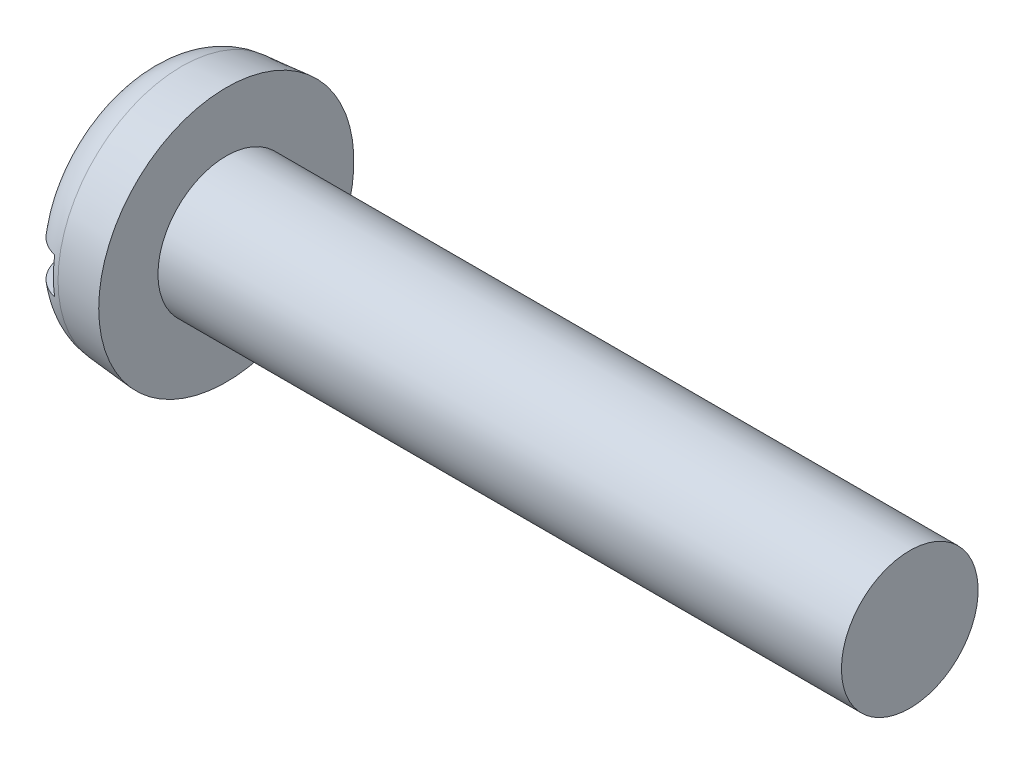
ISO-10303-21;
HEADER;
FILE_DESCRIPTION(('STEP AP214'),'2;1');
FILE_NAME('part.step','',(''),(''),'','','');
FILE_SCHEMA(('AUTOMOTIVE_DESIGN { 1 0 10303 214 1 1 1 1 }'));
ENDSEC;
DATA;
#1=APPLICATION_CONTEXT('core data for automotive mechanical design processes');
#2=APPLICATION_PROTOCOL_DEFINITION('international standard','automotive_design',2000,#1);
#3=PRODUCT_CONTEXT('',#1,'mechanical');
#4=PRODUCT('Part','Part','',(#3));
#5=PRODUCT_RELATED_PRODUCT_CATEGORY('part','',(#4));
#6=PRODUCT_DEFINITION_FORMATION('','',#4);
#7=PRODUCT_DEFINITION_CONTEXT('part definition',#1,'design');
#8=PRODUCT_DEFINITION('design','',#6,#7);
#9=PRODUCT_DEFINITION_SHAPE('','',#8);
#10=(LENGTH_UNIT() NAMED_UNIT(*) SI_UNIT(.MILLI.,.METRE.));
#11=(NAMED_UNIT(*) PLANE_ANGLE_UNIT() SI_UNIT($,.RADIAN.));
#12=(NAMED_UNIT(*) SI_UNIT($,.STERADIAN.) SOLID_ANGLE_UNIT());
#13=UNCERTAINTY_MEASURE_WITH_UNIT(LENGTH_MEASURE(1.E-05),#10,'distance_accuracy_value','');
#14=(GEOMETRIC_REPRESENTATION_CONTEXT(3) GLOBAL_UNCERTAINTY_ASSIGNED_CONTEXT((#13)) GLOBAL_UNIT_ASSIGNED_CONTEXT((#10,
#11,#12)) REPRESENTATION_CONTEXT('',''));
#15=CARTESIAN_POINT('',(0.,0.,0.));
#16=DIRECTION('',(0.,0.,1.));
#17=DIRECTION('',(1.,0.,0.));
#18=AXIS2_PLACEMENT_3D('',#15,#16,#17);
#19=CARTESIAN_POINT('',(0.,0.,0.));
#20=DIRECTION('',(-1.,0.,0.));
#21=DIRECTION('',(0.,0.,1.));
#22=AXIS2_PLACEMENT_3D('',#19,#20,#21);
#23=PLANE('',#22);
#24=DIRECTION('',(0.,0.,-1.));
#25=VECTOR('',#24,1.);
#26=CARTESIAN_POINT('',(0.,0.399999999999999,2.8));
#27=LINE('',#26,#25);
#28=CARTESIAN_POINT('',(0.,0.399999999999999,1.77326763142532));
#29=VERTEX_POINT('',#28);
#30=CARTESIAN_POINT('',(0.,0.399999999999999,-1.77326763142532));
#31=VERTEX_POINT('',#30);
#32=EDGE_CURVE('E85',#29,#31,#27,.T.);
#33=ORIENTED_EDGE('',*,*,#32,.F.);
#34=CARTESIAN_POINT('',(0.,0.,0.));
#35=DIRECTION('',(-1.,0.,0.));
#36=DIRECTION('',(0.,0.,1.));
#37=AXIS2_PLACEMENT_3D('',#34,#35,#36);
#38=CIRCLE('',#37,1.81782234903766);
#39=EDGE_CURVE('E91',#29,#31,#38,.T.);
#40=ORIENTED_EDGE('',*,*,#39,.T.);
#41=EDGE_LOOP('',(#33,#40));
#42=FACE_BOUND('',#41,.T.);
#43=ADVANCED_FACE('F32',(#42),#23,.T.);
#44=CARTESIAN_POINT('',(-25.4,0.,0.));
#45=DIRECTION('',(-1.,0.,0.));
#46=DIRECTION('',(0.,0.,1.));
#47=AXIS2_PLACEMENT_3D('',#44,#45,#46);
#48=CYLINDRICAL_SURFACE('',#47,1.5);
#49=CARTESIAN_POINT('',(16.8,0.,0.));
#50=DIRECTION('',(-1.,0.,0.));
#51=DIRECTION('',(0.,0.,1.));
#52=AXIS2_PLACEMENT_3D('',#49,#50,#51);
#53=CIRCLE('',#52,1.5);
#54=CARTESIAN_POINT('',(16.8,0.,1.5));
#55=VERTEX_POINT('',#54);
#56=EDGE_CURVE('E92',#55,#55,#53,.T.);
#57=ORIENTED_EDGE('',*,*,#56,.T.);
#58=EDGE_LOOP('',(#57));
#59=FACE_BOUND('',#58,.T.);
#60=CARTESIAN_POINT('',(1.8,0.,0.));
#61=DIRECTION('',(-1.,0.,0.));
#62=DIRECTION('',(0.,0.,1.));
#63=AXIS2_PLACEMENT_3D('',#60,#61,#62);
#64=CIRCLE('',#63,1.5);
#65=CARTESIAN_POINT('',(1.8,0.,1.5));
#66=VERTEX_POINT('',#65);
#67=EDGE_CURVE('E149',#66,#66,#64,.T.);
#68=ORIENTED_EDGE('',*,*,#67,.F.);
#69=EDGE_LOOP('',(#68));
#70=FACE_BOUND('',#69,.T.);
#71=ADVANCED_FACE('F137',(#59,#70),#48,.T.);
#72=CARTESIAN_POINT('',(16.8,1.5,0.));
#73=DIRECTION('',(1.,0.,0.));
#74=DIRECTION('',(0.,0.,-1.));
#75=AXIS2_PLACEMENT_3D('',#72,#73,#74);
#76=PLANE('',#75);
#77=ORIENTED_EDGE('',*,*,#56,.F.);
#78=EDGE_LOOP('',(#77));
#79=FACE_BOUND('',#78,.T.);
#80=ADVANCED_FACE('F135',(#79),#76,.T.);
#81=DIRECTION('',(0.,0.,1.));
#82=VECTOR('',#81,1.);
#83=CARTESIAN_POINT('',(0.,-0.4,-2.8));
#84=LINE('',#83,#82);
#85=CARTESIAN_POINT('',(0.,-0.4,-1.77326763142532));
#86=VERTEX_POINT('',#85);
#87=CARTESIAN_POINT('',(0.,-0.4,1.77326763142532));
#88=VERTEX_POINT('',#87);
#89=EDGE_CURVE('E76',#86,#88,#84,.T.);
#90=ORIENTED_EDGE('',*,*,#89,.F.);
#91=EDGE_CURVE('E83',#86,#88,#38,.T.);
#92=ORIENTED_EDGE('',*,*,#91,.T.);
#93=EDGE_LOOP('',(#90,#92));
#94=FACE_BOUND('',#93,.T.);
#95=ADVANCED_FACE('F82',(#94),#23,.T.);
#96=CARTESIAN_POINT('',(0.,0.,0.));
#97=DIRECTION('',(1.,0.,0.));
#98=DIRECTION('',(0.,0.,-1.));
#99=AXIS2_PLACEMENT_3D('',#96,#97,#98);
#100=CONICAL_SURFACE('',#99,2.64252040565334,0.087266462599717);
#101=CARTESIAN_POINT('',(0.821559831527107,0.,0.));
#102=DIRECTION('',(-1.,0.,0.));
#103=DIRECTION('',(0.,0.,1.));
#104=AXIS2_PLACEMENT_3D('',#101,#102,#103);
#105=CIRCLE('',#104,2.71439757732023);
#106=CARTESIAN_POINT('',(0.821559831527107,0.,2.71439757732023));
#107=VERTEX_POINT('',#106);
#108=EDGE_CURVE('E95',#107,#107,#105,.F.);
#109=ORIENTED_EDGE('',*,*,#108,.T.);
#110=EDGE_LOOP('',(#109));
#111=FACE_BOUND('',#110,.T.);
#112=CARTESIAN_POINT('',(1.8,0.,0.));
#113=DIRECTION('',(-1.,0.,0.));
#114=DIRECTION('',(0.,0.,1.));
#115=AXIS2_PLACEMENT_3D('',#112,#113,#114);
#116=CIRCLE('',#115,2.8);
#117=CARTESIAN_POINT('',(1.8,0.,2.8));
#118=VERTEX_POINT('',#117);
#119=EDGE_CURVE('E97',#118,#118,#116,.T.);
#120=ORIENTED_EDGE('',*,*,#119,.T.);
#121=EDGE_LOOP('',(#120));
#122=FACE_BOUND('',#121,.T.);
#123=ADVANCED_FACE('F128',(#111,#122),#100,.T.);
#124=CARTESIAN_POINT('',(1.8,1.5,0.));
#125=DIRECTION('',(-1.,0.,0.));
#126=DIRECTION('',(0.,0.,1.));
#127=AXIS2_PLACEMENT_3D('',#124,#125,#126);
#128=PLANE('',#127);
#129=ORIENTED_EDGE('',*,*,#119,.F.);
#130=EDGE_LOOP('',(#129));
#131=FACE_BOUND('',#130,.T.);
#132=ORIENTED_EDGE('',*,*,#67,.T.);
#133=EDGE_LOOP('',(#132));
#134=FACE_BOUND('',#133,.T.);
#135=ADVANCED_FACE('F124',(#131,#134),#128,.F.);
#136=CARTESIAN_POINT('',(0.9,0.,0.));
#137=DIRECTION('',(-1.,0.,0.));
#138=DIRECTION('',(0.,0.,1.));
#139=AXIS2_PLACEMENT_3D('',#136,#137,#138);
#140=TOROIDAL_SURFACE('',#139,1.81782234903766,0.9);
#141=CARTESIAN_POINT('',(0.285780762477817,0.399999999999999,-2.44311963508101));
#142=CARTESIAN_POINT('',(0.322325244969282,0.399999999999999,-2.47769297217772));
#143=CARTESIAN_POINT('',(0.361794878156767,0.399999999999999,-2.50922544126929));
#144=CARTESIAN_POINT('',(0.445493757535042,0.399999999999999,-2.56525291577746));
#145=CARTESIAN_POINT('',(0.48972822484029,0.399999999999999,-2.58974009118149));
#146=CARTESIAN_POINT('',(0.581685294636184,0.399999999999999,-2.63091846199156));
#147=CARTESIAN_POINT('',(0.629407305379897,0.399999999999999,-2.64761097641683));
#148=CARTESIAN_POINT('',(0.726972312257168,0.399999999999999,-2.67270033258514));
#149=CARTESIAN_POINT('',(0.776814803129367,0.399999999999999,-2.68109913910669));
#150=CARTESIAN_POINT('',(0.876977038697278,0.399999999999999,-2.68933922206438));
#151=CARTESIAN_POINT('',(0.92729364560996,0.399999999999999,-2.68921866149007));
#152=CARTESIAN_POINT('',(1.02719093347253,0.399999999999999,-2.68051830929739));
#153=CARTESIAN_POINT('',(1.07677160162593,0.399999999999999,-2.67193837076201));
#154=CARTESIAN_POINT('',(1.17371760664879,0.399999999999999,-2.6465919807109));
#155=CARTESIAN_POINT('',(1.2210859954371,0.399999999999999,-2.62983719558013));
#156=CARTESIAN_POINT('',(1.31235127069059,0.399999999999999,-2.58864040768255));
#157=CARTESIAN_POINT('',(1.35624813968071,0.399999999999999,-2.56419836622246));
#158=CARTESIAN_POINT('',(1.43950339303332,0.399999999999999,-2.50824069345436));
#159=CARTESIAN_POINT('',(1.47884484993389,0.399999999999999,-2.47669988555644));
#160=CARTESIAN_POINT('',(1.55173067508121,0.399999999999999,-2.40751412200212));
#161=CARTESIAN_POINT('',(1.5852748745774,0.399999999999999,-2.36986898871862));
#162=CARTESIAN_POINT('',(1.64594872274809,0.399999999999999,-2.28919528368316));
#163=CARTESIAN_POINT('',(1.67301846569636,0.399999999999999,-2.24612167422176));
#164=CARTESIAN_POINT('',(1.71966197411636,0.399999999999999,-2.15609376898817));
#165=CARTESIAN_POINT('',(1.73923530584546,0.399999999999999,-2.10913924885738));
#166=CARTESIAN_POINT('',(1.77066025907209,0.399999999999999,-2.01194193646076));
#167=CARTESIAN_POINT('',(1.78239254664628,0.399999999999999,-1.96166058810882));
#168=CARTESIAN_POINT('',(1.7974373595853,0.399999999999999,-1.85985639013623));
#169=CARTESIAN_POINT('',(1.80074908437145,0.399999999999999,-1.80833342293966));
#170=CARTESIAN_POINT('',(1.79894832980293,0.399999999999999,-1.70434405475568));
#171=CARTESIAN_POINT('',(1.79365584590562,0.399999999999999,-1.651880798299));
#172=CARTESIAN_POINT('',(1.77456092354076,0.399999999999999,-1.54852841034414));
#173=CARTESIAN_POINT('',(1.76075741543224,0.399999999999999,-1.49763947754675));
#174=CARTESIAN_POINT('',(1.7246504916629,0.399999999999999,-1.3975266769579));
#175=CARTESIAN_POINT('',(1.70214283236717,0.399999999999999,-1.34837644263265));
#176=CARTESIAN_POINT('',(1.64933120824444,0.399999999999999,-1.25444995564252));
#177=CARTESIAN_POINT('',(1.6190255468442,0.399999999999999,-1.20967465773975));
#178=CARTESIAN_POINT('',(1.55085214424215,0.399999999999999,-1.12504927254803));
#179=CARTESIAN_POINT('',(1.51286662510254,0.399999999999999,-1.08529386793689));
#180=CARTESIAN_POINT('',(1.4306134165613,0.399999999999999,-1.01288372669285));
#181=CARTESIAN_POINT('',(1.38634513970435,0.399999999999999,-0.980229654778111));
#182=CARTESIAN_POINT('',(1.29378824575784,0.399999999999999,-0.924048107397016));
#183=CARTESIAN_POINT('',(1.24562231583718,0.399999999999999,-0.900319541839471));
#184=CARTESIAN_POINT('',(1.14574424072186,0.399999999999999,-0.862177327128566));
#185=CARTESIAN_POINT('',(1.09403573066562,0.399999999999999,-0.847754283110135));
#186=CARTESIAN_POINT('',(0.993395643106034,0.399999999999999,-0.830011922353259));
#187=CARTESIAN_POINT('',(0.944615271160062,0.399999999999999,-0.825833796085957));
#188=CARTESIAN_POINT('',(0.847107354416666,0.399999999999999,-0.826334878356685));
#189=CARTESIAN_POINT('',(0.798379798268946,0.399999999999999,-0.831011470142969));
#190=CARTESIAN_POINT('',(0.705495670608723,0.399999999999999,-0.848340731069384));
#191=CARTESIAN_POINT('',(0.661242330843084,0.399999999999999,-0.860484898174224));
#192=CARTESIAN_POINT('',(0.575232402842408,0.399999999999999,-0.891650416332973));
#193=CARTESIAN_POINT('',(0.53347652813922,0.399999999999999,-0.910673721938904));
#194=CARTESIAN_POINT('',(0.451191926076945,0.399999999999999,-0.956010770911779));
#195=CARTESIAN_POINT('',(0.410848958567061,0.399999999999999,-0.982660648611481));
#196=CARTESIAN_POINT('',(0.334722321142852,0.399999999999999,-1.04182188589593));
#197=CARTESIAN_POINT('',(0.298940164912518,0.399999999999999,-1.0743351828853));
#198=CARTESIAN_POINT('',(0.229649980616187,0.399999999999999,-1.14749226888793));
#199=CARTESIAN_POINT('',(0.19663491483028,0.399999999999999,-1.18860403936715));
#200=CARTESIAN_POINT('',(0.137645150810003,0.399999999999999,-1.27560624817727));
#201=CARTESIAN_POINT('',(0.111672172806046,0.399999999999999,-1.32149785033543));
#202=CARTESIAN_POINT('',(0.0665593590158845,0.399999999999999,-1.41881690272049));
#203=CARTESIAN_POINT('',(0.0477401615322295,0.399999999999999,-1.47039354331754));
#204=CARTESIAN_POINT('',(0.0191028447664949,0.399999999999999,-1.57598967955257));
#205=CARTESIAN_POINT('',(0.0092842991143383,0.399999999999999,-1.63000905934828));
#206=CARTESIAN_POINT('',(-0.000908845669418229,0.399999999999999,-1.73850050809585));
#207=CARTESIAN_POINT('',(-0.00135843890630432,0.399999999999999,-1.7929654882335));
#208=CARTESIAN_POINT('',(0.00713794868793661,0.399999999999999,-1.90117587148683));
#209=CARTESIAN_POINT('',(0.0160852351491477,0.399999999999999,-1.9549211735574));
#210=CARTESIAN_POINT('',(0.0428869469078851,0.399999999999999,-2.05874477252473));
#211=CARTESIAN_POINT('',(0.0605196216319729,0.399999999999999,-2.10888044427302));
#212=CARTESIAN_POINT('',(0.104140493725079,0.399999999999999,-2.20532358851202));
#213=CARTESIAN_POINT('',(0.130117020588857,0.399999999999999,-2.25163629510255));
#214=CARTESIAN_POINT('',(0.178150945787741,0.399999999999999,-2.32211375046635));
#215=CARTESIAN_POINT('',(0.197843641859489,0.399999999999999,-2.34792122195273));
#216=CARTESIAN_POINT('',(0.239879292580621,0.399999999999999,-2.39728022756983));
#217=CARTESIAN_POINT('',(0.26222221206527,0.399999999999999,-2.42083179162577));
#218=CARTESIAN_POINT('',(0.285780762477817,0.399999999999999,-2.44311963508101));
#219=B_SPLINE_CURVE_WITH_KNOTS('',3,(#141,#142,#143,#144,#145,#146,#147,#148,#149,#150,#151,
#152,#153,#154,#155,#156,#157,#158,#159,#160,#161,#162,#163,#164,#165,#166,#167,#168,#169,#170,
#171,#172,#173,#174,#175,#176,#177,#178,#179,#180,#181,#182,#183,#184,#185,#186,#187,#188,#189,
#190,#191,#192,#193,#194,#195,#196,#197,#198,#199,#200,#201,#202,#203,#204,#205,#206,#207,#208,
#209,#210,#211,#212,#213,#214,#215,#216,#217,#218),.UNSPECIFIED.,.T.,.F.,(4,2,2,2,2,2,2,2,2,2,2,
2,2,2,2,2,2,2,2,2,2,2,2,2,2,2,2,2,2,2,2,2,2,2,2,2,2,2,4),(0.,0.15080428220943,0.301775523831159,
0.452721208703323,0.603631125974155,0.753865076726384,0.904101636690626,1.05412441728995,
1.2041479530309,1.35471219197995,1.50528081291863,1.65719291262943,1.80911380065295,
1.96329712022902,2.11749509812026,2.27496068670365,2.43244606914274,2.59387611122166,
2.75534130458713,2.9195015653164,3.08367718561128,3.24389389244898,3.40394859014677,
3.55004213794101,3.69609251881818,3.83315592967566,3.97025831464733,4.11470991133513,
4.25920932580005,4.41668805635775,4.57420522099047,4.73812462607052,4.90203626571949,
5.06463536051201,5.22725705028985,5.38592661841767,5.54437521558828,5.64159310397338,
5.73880970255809),.UNSPECIFIED.);
#220=CARTESIAN_POINT('',(0.7,0.399999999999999,-2.66547244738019));
#221=VERTEX_POINT('',#220);
#222=EDGE_CURVE('E11',#31,#221,#219,.T.);
#223=ORIENTED_EDGE('',*,*,#222,.F.);
#224=ORIENTED_EDGE('',*,*,#39,.F.);
#225=CARTESIAN_POINT('',(0.356169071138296,0.399999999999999,1.02545886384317));
#226=CARTESIAN_POINT('',(0.394477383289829,0.399999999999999,0.994276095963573));
#227=CARTESIAN_POINT('',(0.435252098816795,0.399999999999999,0.966090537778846));
#228=CARTESIAN_POINT('',(0.520874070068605,0.399999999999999,0.916713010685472));
#229=CARTESIAN_POINT('',(0.56572297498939,0.399999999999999,0.895523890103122));
#230=CARTESIAN_POINT('',(0.658585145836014,0.399999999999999,0.861072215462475));
#231=CARTESIAN_POINT('',(0.706609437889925,0.399999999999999,0.84783908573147));
#232=CARTESIAN_POINT('',(0.80424325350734,0.399999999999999,0.83024223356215));
#233=CARTESIAN_POINT('',(0.853851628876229,0.399999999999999,0.825872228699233));
#234=CARTESIAN_POINT('',(0.950010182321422,0.399999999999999,0.826277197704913));
#235=CARTESIAN_POINT('',(0.99656347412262,0.399999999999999,0.830513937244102));
#236=CARTESIAN_POINT('',(1.08828168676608,0.399999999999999,0.846797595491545));
#237=CARTESIAN_POINT('',(1.1334463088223,0.399999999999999,0.858846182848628));
#238=CARTESIAN_POINT('',(1.22099947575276,0.399999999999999,0.890027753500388));
#239=CARTESIAN_POINT('',(1.26339999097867,0.399999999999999,0.909127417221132));
#240=CARTESIAN_POINT('',(1.34475562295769,0.399999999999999,0.953613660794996));
#241=CARTESIAN_POINT('',(1.38370973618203,0.399999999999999,0.979002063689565));
#242=CARTESIAN_POINT('',(1.4606297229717,0.399999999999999,1.03768873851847));
#243=CARTESIAN_POINT('',(1.49821861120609,0.399999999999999,1.07148126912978));
#244=CARTESIAN_POINT('',(1.56766557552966,0.399999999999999,1.14451739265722));
#245=CARTESIAN_POINT('',(1.59952174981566,0.399999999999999,1.18376278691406));
#246=CARTESIAN_POINT('',(1.65882951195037,0.399999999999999,1.26965174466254));
#247=CARTESIAN_POINT('',(1.68580874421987,0.399999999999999,1.3166225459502));
#248=CARTESIAN_POINT('',(1.7316261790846,0.399999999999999,1.41438438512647));
#249=CARTESIAN_POINT('',(1.7504634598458,0.399999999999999,1.46517585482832));
#250=CARTESIAN_POINT('',(1.77959171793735,0.399999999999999,1.56990546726));
#251=CARTESIAN_POINT('',(1.78976336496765,0.399999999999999,1.62387693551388));
#252=CARTESIAN_POINT('',(1.80070617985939,0.399999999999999,1.73276786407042));
#253=CARTESIAN_POINT('',(1.80147810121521,0.399999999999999,1.78768724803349));
#254=CARTESIAN_POINT('',(1.7935515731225,0.399999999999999,1.89576039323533));
#255=CARTESIAN_POINT('',(1.78503812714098,0.399999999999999,1.94892767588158));
#256=CARTESIAN_POINT('',(1.75897009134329,0.399999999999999,2.05299963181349));
#257=CARTESIAN_POINT('',(1.74141670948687,0.399999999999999,2.10390460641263));
#258=CARTESIAN_POINT('',(1.69825810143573,0.399999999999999,2.20064023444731));
#259=CARTESIAN_POINT('',(1.67286703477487,0.399999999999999,2.24656646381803));
#260=CARTESIAN_POINT('',(1.61458416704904,0.399999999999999,2.33338474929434));
#261=CARTESIAN_POINT('',(1.58169323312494,0.399999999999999,2.37427738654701));
#262=CARTESIAN_POINT('',(1.51007060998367,0.399999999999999,2.44900649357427));
#263=CARTESIAN_POINT('',(1.47146964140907,0.399999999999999,2.48296829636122));
#264=CARTESIAN_POINT('',(1.38904817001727,0.399999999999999,2.54382334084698));
#265=CARTESIAN_POINT('',(1.34522808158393,0.399999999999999,2.57071714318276));
#266=CARTESIAN_POINT('',(1.25424836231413,0.399999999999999,2.61630908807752));
#267=CARTESIAN_POINT('',(1.20714119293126,0.399999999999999,2.63511196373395));
#268=CARTESIAN_POINT('',(1.11042474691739,0.399999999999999,2.66447616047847));
#269=CARTESIAN_POINT('',(1.06081558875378,0.399999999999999,2.67503787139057));
#270=CARTESIAN_POINT('',(0.960893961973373,0.399999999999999,2.68755622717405));
#271=CARTESIAN_POINT('',(0.910589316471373,0.399999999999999,2.68957539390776));
#272=CARTESIAN_POINT('',(0.810358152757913,0.399999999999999,2.68512046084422));
#273=CARTESIAN_POINT('',(0.760431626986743,0.399999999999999,2.67864653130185));
#274=CARTESIAN_POINT('',(0.662478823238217,0.399999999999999,2.65741995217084));
#275=CARTESIAN_POINT('',(0.614448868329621,0.399999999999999,2.64268425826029));
#276=CARTESIAN_POINT('',(0.521534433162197,0.399999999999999,2.60538142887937));
#277=CARTESIAN_POINT('',(0.476649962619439,0.399999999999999,2.58281426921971));
#278=CARTESIAN_POINT('',(0.391148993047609,0.399999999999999,2.53043182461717));
#279=CARTESIAN_POINT('',(0.350545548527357,0.399999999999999,2.50059523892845));
#280=CARTESIAN_POINT('',(0.274874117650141,0.399999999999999,2.43457977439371));
#281=CARTESIAN_POINT('',(0.239806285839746,0.399999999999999,2.39840071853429));
#282=CARTESIAN_POINT('',(0.1758792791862,0.399999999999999,2.32042102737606));
#283=CARTESIAN_POINT('',(0.147073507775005,0.399999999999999,2.27857662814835));
#284=CARTESIAN_POINT('',(0.0967847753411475,0.399999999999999,2.19069995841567));
#285=CARTESIAN_POINT('',(0.07530224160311,0.399999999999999,2.14466744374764));
#286=CARTESIAN_POINT('',(0.0399276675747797,0.399999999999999,2.04903409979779));
#287=CARTESIAN_POINT('',(0.0261471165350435,0.399999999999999,1.99939205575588));
#288=CARTESIAN_POINT('',(0.00693602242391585,0.399999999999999,1.89852251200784));
#289=CARTESIAN_POINT('',(0.00150590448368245,0.399999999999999,1.84729493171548));
#290=CARTESIAN_POINT('',(-0.000985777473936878,0.399999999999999,1.74359522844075));
#291=CARTESIAN_POINT('',(0.0021251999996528,0.399999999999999,1.69111899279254));
#292=CARTESIAN_POINT('',(0.0168916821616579,0.399999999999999,1.58737297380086));
#293=CARTESIAN_POINT('',(0.0285499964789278,0.399999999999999,1.53610359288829));
#294=CARTESIAN_POINT('',(0.0604020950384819,0.399999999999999,1.43486374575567));
#295=CARTESIAN_POINT('',(0.080804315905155,0.399999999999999,1.38495893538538));
#296=CARTESIAN_POINT('',(0.129530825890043,0.399999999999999,1.28921347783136));
#297=CARTESIAN_POINT('',(0.157849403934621,0.399999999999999,1.24336993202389));
#298=CARTESIAN_POINT('',(0.213684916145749,0.399999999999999,1.16773658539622));
#299=CARTESIAN_POINT('',(0.239651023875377,0.399999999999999,1.13678903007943));
#300=CARTESIAN_POINT('',(0.29525297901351,0.399999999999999,1.07838116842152));
#301=CARTESIAN_POINT('',(0.324888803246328,0.399999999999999,1.05092084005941));
#302=CARTESIAN_POINT('',(0.356169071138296,0.399999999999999,1.02545886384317));
#303=B_SPLINE_CURVE_WITH_KNOTS('',3,(#225,#226,#227,#228,#229,#230,#231,#232,#233,#234,#235,
#236,#237,#238,#239,#240,#241,#242,#243,#244,#245,#246,#247,#248,#249,#250,#251,#252,#253,#254,
#255,#256,#257,#258,#259,#260,#261,#262,#263,#264,#265,#266,#267,#268,#269,#270,#271,#272,#273,
#274,#275,#276,#277,#278,#279,#280,#281,#282,#283,#284,#285,#286,#287,#288,#289,#290,#291,#292,
#293,#294,#295,#296,#297,#298,#299,#300,#301,#302),.UNSPECIFIED.,.T.,.F.,(4,2,2,2,2,2,2,2,2,2,2,
2,2,2,2,2,2,2,2,2,2,2,2,2,2,2,2,2,2,2,2,2,2,2,2,2,2,2,4),(0.,0.148056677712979,
0.296173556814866,0.444834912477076,0.593390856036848,0.732942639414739,0.87252424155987,
1.01145452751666,1.15042513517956,1.30141738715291,1.45245963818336,1.61420969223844,
1.7759780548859,1.93993961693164,2.10388803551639,2.26462860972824,2.42534771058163,
2.58201478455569,2.73866375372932,2.89216335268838,3.04565077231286,3.19708679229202,
3.34851564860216,3.49883427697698,3.64914989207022,3.79915813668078,3.94916684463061,
4.09962050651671,4.25007836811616,4.40177296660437,4.55347641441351,4.70732244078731,
4.86117629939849,5.0181609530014,5.17519723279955,5.33620557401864,5.49709805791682,
5.61799301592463,5.73888721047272),.UNSPECIFIED.);
#304=CARTESIAN_POINT('',(0.7,0.399999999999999,2.66547244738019));
#305=VERTEX_POINT('',#304);
#306=EDGE_CURVE('E109',#305,#29,#303,.T.);
#307=ORIENTED_EDGE('',*,*,#306,.F.);
#308=CARTESIAN_POINT('',(0.7,0.,0.));
#309=DIRECTION('',(-1.,0.,0.));
#310=DIRECTION('',(0.,0.,1.));
#311=AXIS2_PLACEMENT_3D('',#308,#309,#310);
#312=CIRCLE('',#311,2.69531878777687);
#313=CARTESIAN_POINT('',(0.7,-0.4,2.66547244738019));
#314=VERTEX_POINT('',#313);
#315=EDGE_CURVE('E103',#305,#314,#312,.F.);
#316=ORIENTED_EDGE('',*,*,#315,.T.);
#317=CARTESIAN_POINT('',(0.356169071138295,-0.4,1.02545886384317));
#318=CARTESIAN_POINT('',(0.314031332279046,-0.4,1.05976167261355));
#319=CARTESIAN_POINT('',(0.274819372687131,-0.4,1.0977427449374));
#320=CARTESIAN_POINT('',(0.20326819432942,-0.4,1.17978565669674));
#321=CARTESIAN_POINT('',(0.170942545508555,-0.4,1.22385922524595));
#322=CARTESIAN_POINT('',(0.114111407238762,-0.4,1.31672727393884));
#323=CARTESIAN_POINT('',(0.0895968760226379,-0.4,1.36551620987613));
#324=CARTESIAN_POINT('',(0.0490785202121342,-0.4,1.46648183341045));
#325=CARTESIAN_POINT('',(0.0330703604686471,-0.4,1.51865678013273));
#326=CARTESIAN_POINT('',(0.0100453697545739,-0.4,1.62518908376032));
#327=CARTESIAN_POINT('',(0.00306618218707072,-0.4,1.67955460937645));
#328=CARTESIAN_POINT('',(-0.00144685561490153,-0.4,1.78868546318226));
#329=CARTESIAN_POINT('',(0.00101939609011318,-0.4,1.84345079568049));
#330=CARTESIAN_POINT('',(0.0152891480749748,-0.4,1.95052330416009));
#331=CARTESIAN_POINT('',(0.0268854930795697,-0.4,2.0028580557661));
#332=CARTESIAN_POINT('',(0.0589248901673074,-0.4,2.10474672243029));
#333=CARTESIAN_POINT('',(0.0793666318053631,-0.4,2.15430104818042));
#334=CARTESIAN_POINT('',(0.12795627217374,-0.4,2.24792186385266));
#335=CARTESIAN_POINT('',(0.155901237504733,-0.4,2.29209371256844));
#336=CARTESIAN_POINT('',(0.218944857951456,-0.4,2.37499861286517));
#337=CARTESIAN_POINT('',(0.254042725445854,-0.4,2.41373226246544));
#338=CARTESIAN_POINT('',(0.32966685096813,-0.4,2.48389534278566));
#339=CARTESIAN_POINT('',(0.370077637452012,-0.4,2.51544927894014));
#340=CARTESIAN_POINT('',(0.455677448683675,-0.4,2.57122459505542));
#341=CARTESIAN_POINT('',(0.500866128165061,-0.4,2.59544650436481));
#342=CARTESIAN_POINT('',(0.59413782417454,-0.4,2.6355729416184));
#343=CARTESIAN_POINT('',(0.642178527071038,-0.4,2.65157587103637));
#344=CARTESIAN_POINT('',(0.740273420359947,-0.4,2.67523109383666));
#345=CARTESIAN_POINT('',(0.790327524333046,-0.4,2.68288374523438));
#346=CARTESIAN_POINT('',(0.890686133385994,-0.4,2.68958762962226));
#347=CARTESIAN_POINT('',(0.940986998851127,-0.4,2.68869347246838));
#348=CARTESIAN_POINT('',(1.04072178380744,-0.4,2.67846167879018));
#349=CARTESIAN_POINT('',(1.0901557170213,-0.4,2.66912417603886));
#350=CARTESIAN_POINT('',(1.18669599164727,-0.4,2.64229877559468));
#351=CARTESIAN_POINT('',(1.23380501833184,-0.4,2.6248205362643));
#352=CARTESIAN_POINT('',(1.32443528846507,-0.4,2.58223220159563));
#353=CARTESIAN_POINT('',(1.36795650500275,-0.4,2.5571220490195));
#354=CARTESIAN_POINT('',(1.45036421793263,-0.4,2.49989362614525));
#355=CARTESIAN_POINT('',(1.48923230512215,-0.4,2.46774885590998));
#356=CARTESIAN_POINT('',(1.56107927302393,-0.4,2.39744378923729));
#357=CARTESIAN_POINT('',(1.59405796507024,-0.4,2.35928330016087));
#358=CARTESIAN_POINT('',(1.65352847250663,-0.4,2.2776666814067));
#359=CARTESIAN_POINT('',(1.67995797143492,-0.4,2.23416516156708));
#360=CARTESIAN_POINT('',(1.72526137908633,-0.4,2.14339421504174));
#361=CARTESIAN_POINT('',(1.74413484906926,-0.4,2.09612456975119));
#362=CARTESIAN_POINT('',(1.77411508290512,-0.4,1.9983989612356));
#363=CARTESIAN_POINT('',(1.78509960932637,-0.4,1.9479055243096));
#364=CARTESIAN_POINT('',(1.79862667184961,-0.4,1.84580292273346));
#365=CARTESIAN_POINT('',(1.80116838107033,-0.4,1.79419364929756));
#366=CARTESIAN_POINT('',(1.79780993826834,-0.4,1.69014314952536));
#367=CARTESIAN_POINT('',(1.79172746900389,-0.4,1.63770783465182));
#368=CARTESIAN_POINT('',(1.77106806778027,-0.4,1.53454005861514));
#369=CARTESIAN_POINT('',(1.75649007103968,-0.4,1.48380781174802));
#370=CARTESIAN_POINT('',(1.7188487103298,-0.4,1.38413781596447));
#371=CARTESIAN_POINT('',(1.69558194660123,-0.4,1.33527684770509));
#372=CARTESIAN_POINT('',(1.64130257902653,-0.4,1.24205401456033));
#373=CARTESIAN_POINT('',(1.6102882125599,-0.4,1.19769317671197));
#374=CARTESIAN_POINT('',(1.54078360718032,-0.4,1.11407031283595));
#375=CARTESIAN_POINT('',(1.50218355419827,-0.4,1.07489936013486));
#376=CARTESIAN_POINT('',(1.418793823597,-0.4,1.00377929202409));
#377=CARTESIAN_POINT('',(1.37400377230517,-0.4,0.971830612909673));
#378=CARTESIAN_POINT('',(1.28066227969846,-0.4,0.917245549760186));
#379=CARTESIAN_POINT('',(1.23224470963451,-0.4,0.894381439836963));
#380=CARTESIAN_POINT('',(1.13202516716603,-0.4,0.858023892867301));
#381=CARTESIAN_POINT('',(1.08022692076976,-0.4,0.844520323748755));
#382=CARTESIAN_POINT('',(0.979686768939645,-0.4,0.828554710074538));
#383=CARTESIAN_POINT('',(0.93108358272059,-0.4,0.82521631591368));
#384=CARTESIAN_POINT('',(0.834057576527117,-0.4,0.827306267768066));
#385=CARTESIAN_POINT('',(0.785634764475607,-0.4,0.832734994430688));
#386=CARTESIAN_POINT('',(0.693219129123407,-0.4,0.851440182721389));
#387=CARTESIAN_POINT('',(0.6491307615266,-0.4,0.864254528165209));
#388=CARTESIAN_POINT('',(0.563580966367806,-0.4,0.896690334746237));
#389=CARTESIAN_POINT('',(0.522117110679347,-0.4,0.916305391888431));
#390=CARTESIAN_POINT('',(0.460201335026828,-0.4,0.951554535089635));
#391=CARTESIAN_POINT('',(0.438547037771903,-0.4,0.965129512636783));
#392=CARTESIAN_POINT('',(0.396436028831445,-0.4,0.994018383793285));
#393=CARTESIAN_POINT('',(0.375979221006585,-0.4,1.00933213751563));
#394=CARTESIAN_POINT('',(0.356169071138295,-0.4,1.02545886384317));
#395=B_SPLINE_CURVE_WITH_KNOTS('',3,(#317,#318,#319,#320,#321,#322,#323,#324,#325,#326,#327,
#328,#329,#330,#331,#332,#333,#334,#335,#336,#337,#338,#339,#340,#341,#342,#343,#344,#345,#346,
#347,#348,#349,#350,#351,#352,#353,#354,#355,#356,#357,#358,#359,#360,#361,#362,#363,#364,#365,
#366,#367,#368,#369,#370,#371,#372,#373,#374,#375,#376,#377,#378,#379,#380,#381,#382,#383,#384,
#385,#386,#387,#388,#389,#390,#391,#392,#393,#394),.UNSPECIFIED.,.T.,.F.,(4,2,2,2,2,2,2,2,2,2,2,
2,2,2,2,2,2,2,2,2,2,2,2,2,2,2,2,2,2,2,2,2,2,2,2,2,2,2,4),(0.,0.162908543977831,
0.326135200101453,0.489172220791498,0.652126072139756,0.815757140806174,0.979389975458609,
1.13941349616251,1.29941331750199,1.45545894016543,1.61148738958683,1.76455910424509,
1.91761976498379,2.068802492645,2.21997873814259,2.37018969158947,2.52039826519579,
2.67042907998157,2.82046101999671,2.97106818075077,3.12168016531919,3.27367450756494,
3.42567767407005,3.5799880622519,3.73431356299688,3.89195060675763,4.04960741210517,
4.2112132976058,4.37285598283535,4.53703863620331,4.70123120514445,4.86099956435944,
5.02059471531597,5.16597452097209,5.31136063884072,5.44850857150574,5.58552770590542,
5.66212180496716,5.73870974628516),.UNSPECIFIED.);
#396=EDGE_CURVE('E90',#88,#314,#395,.T.);
#397=ORIENTED_EDGE('',*,*,#396,.F.);
#398=ORIENTED_EDGE('',*,*,#91,.F.);
#399=CARTESIAN_POINT('',(0.285780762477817,-0.4,-2.44311963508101));
#400=CARTESIAN_POINT('',(0.248557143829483,-0.4,-2.4078972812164));
#401=CARTESIAN_POINT('',(0.214312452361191,-0.4,-2.3694650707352));
#402=CARTESIAN_POINT('',(0.152768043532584,-0.4,-2.28733938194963));
#403=CARTESIAN_POINT('',(0.125478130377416,-0.4,-2.24363860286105));
#404=CARTESIAN_POINT('',(0.0786257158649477,-0.4,-2.15234079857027));
#405=CARTESIAN_POINT('',(0.0590537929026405,-0.4,-2.10474861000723));
#406=CARTESIAN_POINT('',(0.0280650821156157,-0.4,-2.00700047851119));
#407=CARTESIAN_POINT('',(0.0166461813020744,-0.4,-1.95684520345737));
#408=CARTESIAN_POINT('',(0.00206923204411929,-0.4,-1.85464080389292));
#409=CARTESIAN_POINT('',(-0.000972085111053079,-0.4,-1.80257506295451));
#410=CARTESIAN_POINT('',(0.00151453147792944,-0.4,-1.69864852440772));
#411=CARTESIAN_POINT('',(0.00704382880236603,-0.4,-1.64678776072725));
#412=CARTESIAN_POINT('',(0.0266516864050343,-0.4,-1.5434240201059));
#413=CARTESIAN_POINT('',(0.0409314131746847,-0.4,-1.49195921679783));
#414=CARTESIAN_POINT('',(0.0777275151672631,-0.4,-1.39206285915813));
#415=CARTESIAN_POINT('',(0.100245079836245,-0.4,-1.34363174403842));
#416=CARTESIAN_POINT('',(0.153482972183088,-0.4,-1.2500005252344));
#417=CARTESIAN_POINT('',(0.184382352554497,-0.4,-1.20490211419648));
#418=CARTESIAN_POINT('',(0.253306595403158,-0.4,-1.12049761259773));
#419=CARTESIAN_POINT('',(0.29133345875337,-0.4,-1.08119315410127));
#420=CARTESIAN_POINT('',(0.373599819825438,-0.4,-1.00962170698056));
#421=CARTESIAN_POINT('',(0.417845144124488,-0.4,-0.977361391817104));
#422=CARTESIAN_POINT('',(0.511393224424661,-0.4,-0.921257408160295));
#423=CARTESIAN_POINT('',(0.560693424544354,-0.4,-0.897409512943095));
#424=CARTESIAN_POINT('',(0.659899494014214,-0.4,-0.86056620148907));
#425=CARTESIAN_POINT('',(0.709596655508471,-0.4,-0.847011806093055));
#426=CARTESIAN_POINT('',(0.81063175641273,-0.4,-0.829407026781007));
#427=CARTESIAN_POINT('',(0.861968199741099,-0.4,-0.825348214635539));
#428=CARTESIAN_POINT('',(0.959752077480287,-0.4,-0.82693832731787));
#429=CARTESIAN_POINT('',(1.00621575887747,-0.4,-0.831730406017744));
#430=CARTESIAN_POINT('',(1.09766854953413,-0.4,-0.849077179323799));
#431=CARTESIAN_POINT('',(1.14265739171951,-0.4,-0.861633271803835));
#432=CARTESIAN_POINT('',(1.2299114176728,-0.4,-0.893807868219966));
#433=CARTESIAN_POINT('',(1.27218175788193,-0.4,-0.913412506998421));
#434=CARTESIAN_POINT('',(1.35320643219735,-0.4,-0.958874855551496));
#435=CARTESIAN_POINT('',(1.39195973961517,-0.4,-0.984734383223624));
#436=CARTESIAN_POINT('',(1.46843970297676,-0.4,-1.04440221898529));
#437=CARTESIAN_POINT('',(1.5057776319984,-0.4,-1.07870901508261));
#438=CARTESIAN_POINT('',(1.57463408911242,-0.4,-1.15273784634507));
#439=CARTESIAN_POINT('',(1.60615068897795,-0.4,-1.19246166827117));
#440=CARTESIAN_POINT('',(1.66460952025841,-0.4,-1.27921419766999));
#441=CARTESIAN_POINT('',(1.69108592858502,-0.4,-1.32655784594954));
#442=CARTESIAN_POINT('',(1.73582713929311,-0.4,-1.42498260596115));
#443=CARTESIAN_POINT('',(1.75409110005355,-0.4,-1.47606410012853));
#444=CARTESIAN_POINT('',(1.7819800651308,-0.4,-1.58118959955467));
#445=CARTESIAN_POINT('',(1.79150042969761,-0.4,-1.63526148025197));
#446=CARTESIAN_POINT('',(1.80112725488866,-0.4,-1.74424014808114));
#447=CARTESIAN_POINT('',(1.80123449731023,-0.4,-1.79914686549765));
#448=CARTESIAN_POINT('',(1.79200090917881,-0.4,-1.90704889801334));
#449=CARTESIAN_POINT('',(1.78285023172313,-0.4,-1.96006044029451));
#450=CARTESIAN_POINT('',(1.75554489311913,-0.4,-2.06371351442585));
#451=CARTESIAN_POINT('',(1.73739144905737,-0.4,-2.11435536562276));
#452=CARTESIAN_POINT('',(1.69310212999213,-0.4,-2.21047686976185));
#453=CARTESIAN_POINT('',(1.66717834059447,-0.4,-2.25605427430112));
#454=CARTESIAN_POINT('',(1.60789945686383,-0.4,-2.34209023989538));
#455=CARTESIAN_POINT('',(1.57454519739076,-0.4,-2.38254937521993));
#456=CARTESIAN_POINT('',(1.50207992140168,-0.4,-2.45635864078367));
#457=CARTESIAN_POINT('',(1.46309647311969,-0.4,-2.48983406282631));
#458=CARTESIAN_POINT('',(1.37999946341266,-0.4,-2.54966020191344));
#459=CARTESIAN_POINT('',(1.33588629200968,-0.4,-2.57601146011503));
#460=CARTESIAN_POINT('',(1.24441048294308,-0.4,-2.6204920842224));
#461=CARTESIAN_POINT('',(1.19709806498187,-0.4,-2.63872477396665));
#462=CARTESIAN_POINT('',(1.10007286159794,-0.4,-2.66692299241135));
#463=CARTESIAN_POINT('',(1.05036028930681,-0.4,-2.67688925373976));
#464=CARTESIAN_POINT('',(0.950330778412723,-0.4,-2.68821568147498));
#465=CARTESIAN_POINT('',(0.900020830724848,-0.4,-2.68963769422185));
#466=CARTESIAN_POINT('',(0.799864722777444,-0.4,-2.68399705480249));
#467=CARTESIAN_POINT('',(0.75001868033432,-0.4,-2.67693230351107));
#468=CARTESIAN_POINT('',(0.652295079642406,-0.4,-2.6545442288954));
#469=CARTESIAN_POINT('',(0.6044149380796,-0.4,-2.63923214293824));
#470=CARTESIAN_POINT('',(0.511939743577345,-0.4,-2.60081753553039));
#471=CARTESIAN_POINT('',(0.467340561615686,-0.4,-2.5777250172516));
#472=CARTESIAN_POINT('',(0.40010178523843,-0.4,-2.53543999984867));
#473=CARTESIAN_POINT('',(0.375979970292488,-0.4,-2.51855507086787));
#474=CARTESIAN_POINT('',(0.329505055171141,-0.4,-2.48250598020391));
#475=CARTESIAN_POINT('',(0.307151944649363,-0.4,-2.46334183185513));
#476=CARTESIAN_POINT('',(0.285780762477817,-0.4,-2.44311963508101));
#477=B_SPLINE_CURVE_WITH_KNOTS('',3,(#399,#400,#401,#402,#403,#404,#405,#406,#407,#408,#409,
#410,#411,#412,#413,#414,#415,#416,#417,#418,#419,#420,#421,#422,#423,#424,#425,#426,#427,#428,
#429,#430,#431,#432,#433,#434,#435,#436,#437,#438,#439,#440,#441,#442,#443,#444,#445,#446,#447,
#448,#449,#450,#451,#452,#453,#454,#455,#456,#457,#458,#459,#460,#461,#462,#463,#464,#465,#466,
#467,#468,#469,#470,#471,#472,#473,#474,#475,#476),.UNSPECIFIED.,.T.,.F.,(4,2,2,2,2,2,2,2,2,2,2,
2,2,2,2,2,2,2,2,2,2,2,2,2,2,2,2,2,2,2,2,2,2,2,2,2,2,2,4),(0.,0.153630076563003,0.30747554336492,
0.461132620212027,0.614749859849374,0.770496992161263,0.926268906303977,1.08576372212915,
1.24528157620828,1.40851960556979,1.57180352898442,1.73524147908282,1.89859719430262,
2.05228040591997,2.205827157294,2.34528036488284,2.48475868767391,2.62396413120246,
2.7632100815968,2.91467905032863,3.06619810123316,3.22817436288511,3.39016722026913,
3.55407439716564,3.71796796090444,3.87856222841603,4.03913479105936,4.19567175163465,
4.35219113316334,4.50560019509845,4.65899760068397,4.81038266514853,4.96175431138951,
5.1120289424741,5.26234075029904,5.41244826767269,5.56236352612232,5.65056762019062,
5.73877119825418),.UNSPECIFIED.);
#478=CARTESIAN_POINT('',(0.7,-0.4,-2.66547244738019));
#479=VERTEX_POINT('',#478);
#480=EDGE_CURVE('E44',#479,#86,#477,.T.);
#481=ORIENTED_EDGE('',*,*,#480,.F.);
#482=EDGE_CURVE('E56',#479,#221,#312,.F.);
#483=ORIENTED_EDGE('',*,*,#482,.T.);
#484=EDGE_LOOP('',(#223,#224,#307,#316,#397,#398,#481,#483));
#485=FACE_BOUND('',#484,.T.);
#486=ORIENTED_EDGE('',*,*,#108,.F.);
#487=EDGE_LOOP('',(#486));
#488=FACE_BOUND('',#487,.T.);
#489=ADVANCED_FACE('F34',(#485,#488),#140,.T.);
#490=CARTESIAN_POINT('',(0.7,0.399999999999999,2.8));
#491=DIRECTION('',(0.,1.,0.));
#492=DIRECTION('',(0.,0.,1.));
#493=AXIS2_PLACEMENT_3D('',#490,#491,#492);
#494=PLANE('',#493);
#495=ORIENTED_EDGE('',*,*,#222,.T.);
#496=DIRECTION('',(0.,0.,-1.));
#497=VECTOR('',#496,1.);
#498=CARTESIAN_POINT('',(0.7,0.399999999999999,2.8));
#499=LINE('',#498,#497);
#500=EDGE_CURVE('E84',#305,#221,#499,.T.);
#501=ORIENTED_EDGE('',*,*,#500,.F.);
#502=ORIENTED_EDGE('',*,*,#306,.T.);
#503=ORIENTED_EDGE('',*,*,#32,.T.);
#504=EDGE_LOOP('',(#495,#501,#502,#503));
#505=FACE_BOUND('',#504,.T.);
#506=ADVANCED_FACE('F116',(#505),#494,.F.);
#507=CARTESIAN_POINT('',(0.7,-0.4,-2.8));
#508=DIRECTION('',(0.,-1.,0.));
#509=DIRECTION('',(0.,0.,-1.));
#510=AXIS2_PLACEMENT_3D('',#507,#508,#509);
#511=PLANE('',#510);
#512=ORIENTED_EDGE('',*,*,#480,.T.);
#513=ORIENTED_EDGE('',*,*,#89,.T.);
#514=ORIENTED_EDGE('',*,*,#396,.T.);
#515=DIRECTION('',(0.,0.,1.));
#516=VECTOR('',#515,1.);
#517=CARTESIAN_POINT('',(0.7,-0.4,-2.8));
#518=LINE('',#517,#516);
#519=EDGE_CURVE('E51',#479,#314,#518,.T.);
#520=ORIENTED_EDGE('',*,*,#519,.F.);
#521=EDGE_LOOP('',(#512,#513,#514,#520));
#522=FACE_BOUND('',#521,.T.);
#523=ADVANCED_FACE('F75',(#522),#511,.F.);
#524=CARTESIAN_POINT('',(0.7,0.399999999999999,-2.8));
#525=DIRECTION('',(-1.,0.,0.));
#526=DIRECTION('',(0.,0.,1.));
#527=AXIS2_PLACEMENT_3D('',#524,#525,#526);
#528=PLANE('',#527);
#529=ORIENTED_EDGE('',*,*,#519,.T.);
#530=ORIENTED_EDGE('',*,*,#315,.F.);
#531=ORIENTED_EDGE('',*,*,#500,.T.);
#532=ORIENTED_EDGE('',*,*,#482,.F.);
#533=EDGE_LOOP('',(#529,#530,#531,#532));
#534=FACE_BOUND('',#533,.T.);
#535=ADVANCED_FACE('F115',(#534),#528,.T.);
#536=CLOSED_SHELL('',(#43,#71,#80,#95,#123,#135,#489,#506,#523,#535));
#537=MANIFOLD_SOLID_BREP('B2',#536);
#538=ADVANCED_BREP_SHAPE_REPRESENTATION('',(#18,#537),#14);
#539=SHAPE_DEFINITION_REPRESENTATION(#9,#538);
ENDSEC;
END-ISO-10303-21;
